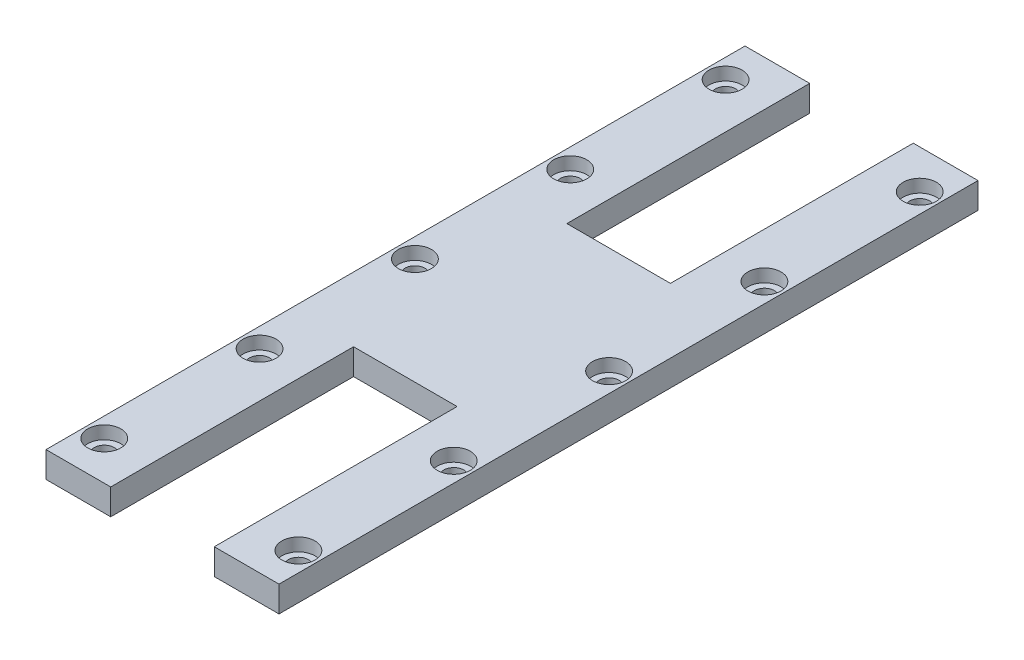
from build123d import *

# Parameters (mm, degrees)
SKETCH1_W           = 57.15
SKETCH1_H           = 6.35
BOSS_EXTRUDE1_DEPTH = 171.45
SKETCH2_W           = 25.4
SKETCH2_H           = 59.563
CUT_EXTRUDE1_DEPTH  = 127
SKETCH3_R           = 2.45745
CUT_EXTRUDE2_DEPTH  = 6.35
SKETCH4_R           = 4.064
CUT_EXTRUDE3_DEPTH  = 3.175


with BuildPart() as part:
    # Sketch1 → Boss-Extrude1 (new body)
    with BuildSketch(Plane.XY):
        with Locations((28.575, 3.175)):
            Rectangle(SKETCH1_W, SKETCH1_H)
    extrude(amount=-BOSS_EXTRUDE1_DEPTH)

    # Sketch2 → Cut-Extrude1 (cut)
    with BuildSketch(Plane(origin=(0, 6.35, 0), x_dir=(1, 0, 0), z_dir=(0, 1, 0))):
        with Locations((28.575, 141.6685)):
            Rectangle(SKETCH2_W, SKETCH2_H)
        with Locations((28.575, 29.7815)):
            Rectangle(SKETCH2_W, SKETCH2_H)
    extrude(amount=-CUT_EXTRUDE1_DEPTH, mode=Mode.SUBTRACT)

    # Sketch3 → Cut-Extrude2 (cut)
    with BuildSketch(Plane(origin=(0, 6.35, 0), x_dir=(1, 0, 0), z_dir=(0, 1, 0))):
        with Locations(Location((4.7625, 161.925, 0), (0, 0, 270))):
            Circle(SKETCH3_R)
        with Locations(Location((4.7625, 123.825, 0), (0, 0, 270))):
            Circle(SKETCH3_R)
        with Locations(Location((4.7625, 85.725, 0), (0, 0, 270))):
            Circle(SKETCH3_R)
        with Locations(Location((4.7625, 47.625, 0), (0, 0, 270))):
            Circle(SKETCH3_R)
        with Locations(Location((52.3875, 123.825, 0), (0, 0, 270))):
            Circle(SKETCH3_R)
        with Locations(Location((52.3875, 85.725, 0), (0, 0, 270))):
            Circle(SKETCH3_R)
        with Locations(Location((52.3875, 47.625, 0), (0, 0, 270))):
            Circle(SKETCH3_R)
        with Locations(Location((52.3875, 9.525, 0), (0, 0, 270))):
            Circle(SKETCH3_R)
        with Locations(Location((4.7625, 9.525, 0), (0, 0, 270))):
            Circle(SKETCH3_R)
        with Locations(Location((52.3875, 161.925, 0), (0, 0, 270))):
            Circle(SKETCH3_R)
    extrude(amount=-CUT_EXTRUDE2_DEPTH, mode=Mode.SUBTRACT)

    # Sketch4 → Cut-Extrude3 (cut)
    with BuildSketch(Plane(origin=(0, 6.35, 0), x_dir=(1, 0, 0), z_dir=(0, 1, 0))):
        with Locations(Location((4.7625, 161.925, 0), (0, 0, 270))):
            Circle(SKETCH4_R)
        with Locations(Location((4.7625, 123.825, 0), (0, 0, 270))):
            Circle(SKETCH4_R)
        with Locations(Location((4.7625, 85.725, 0), (0, 0, 270))):
            Circle(SKETCH4_R)
        with Locations(Location((4.7625, 47.625, 0), (0, 0, 270))):
            Circle(SKETCH4_R)
        with Locations(Location((52.3875, 9.525, 0), (0, 0, 270))):
            Circle(SKETCH4_R)
        with Locations(Location((52.3875, 47.625, 0), (0, 0, 270))):
            Circle(SKETCH4_R)
        with Locations(Location((52.3875, 85.725, 0), (0, 0, 270))):
            Circle(SKETCH4_R)
        with Locations(Location((52.3875, 123.825, 0), (0, 0, 270))):
            Circle(SKETCH4_R)
        with Locations(Location((52.3875, 161.925, 0), (0, 0, 270))):
            Circle(SKETCH4_R)
        with Locations(Location((4.7625, 9.525, 0), (0, 0, 270))):
            Circle(SKETCH4_R)
    extrude(amount=-CUT_EXTRUDE3_DEPTH, mode=Mode.SUBTRACT)


solid = part.part
